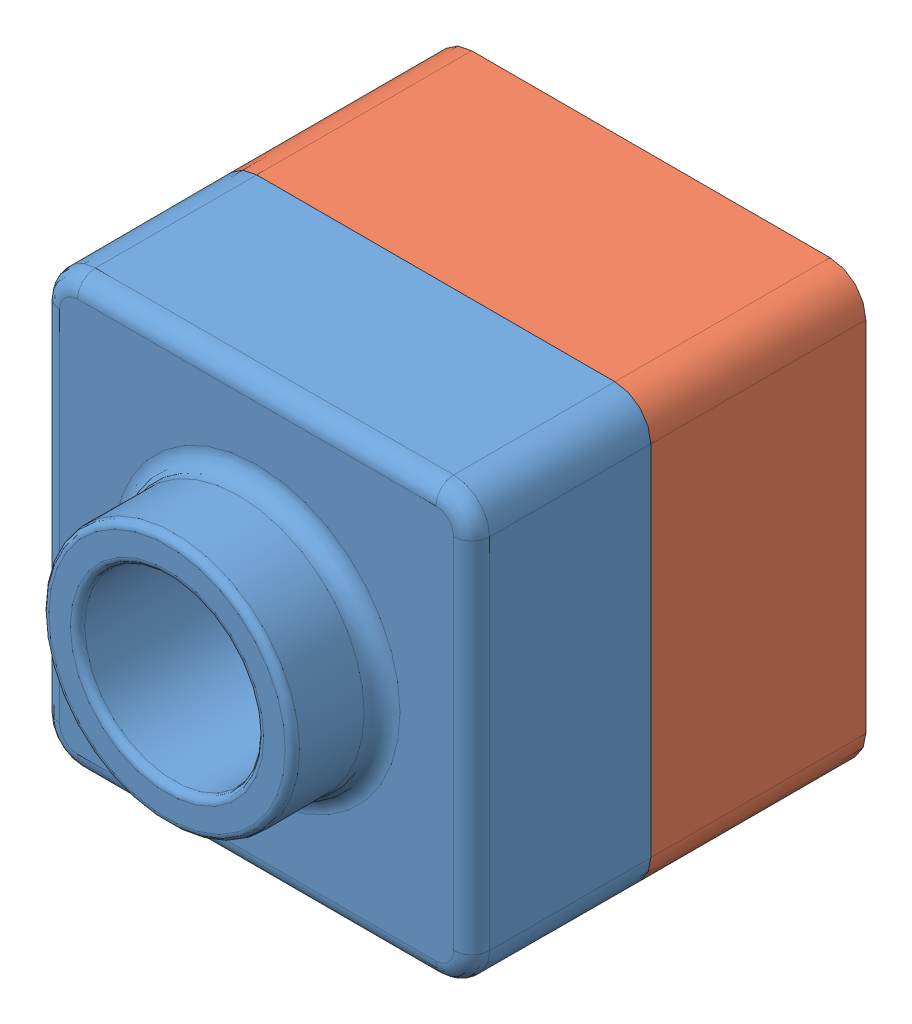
SolidWorks assembly Tutor.SLDASM, configuration Default (file format 4700). Lengths in mm.
Overall size (120 120 135).
2 component instances, 2 part files, 6 mates.
Components (placement in the parent):
- Tutor1-1: Tutor1.SLDPRT [Default] at origin size (120 120 75)
- Tutor2-1: Tutor2.SLDPRT [Default] at (0 0 -60) size (120 120 90)
Mates (geometry in assembly coordinates):
- Coincident1: coincident aligned: line of Tutor1-1 through (110 120 0) axis (-1 0 0); line of Tutor2-1 through (110 120 0) axis (-1 0 0)
- Coincident2: coincident aligned: plane of Tutor1-1 through (120 0 50) normal (1 0 0); plane of Tutor2-1 through (120 0 30) normal (1 0 0)
- Coincident3: coincident aligned: plane of Tutor1-1 through (0 120 50) normal (0 1 0); plane of Tutor2-1 through (0 120 30) normal (0 1 0)
- Coincident4: coincident aligned: plane of Tutor1-1 through (0 0 0) normal (0 0 1); plane of assembly through (0 0 0) normal (0 0 1)
- Coincident5: coincident aligned: plane of Tutor1-1 through (0 0 0) normal (0 1 0); plane of assembly through (0 0 0) normal (0 1 0)
- Coincident6: coincident aligned: plane of Tutor1-1 through (0 0 0) normal (1 0 0); plane of assembly through (0 0 0) normal (1 0 0)
